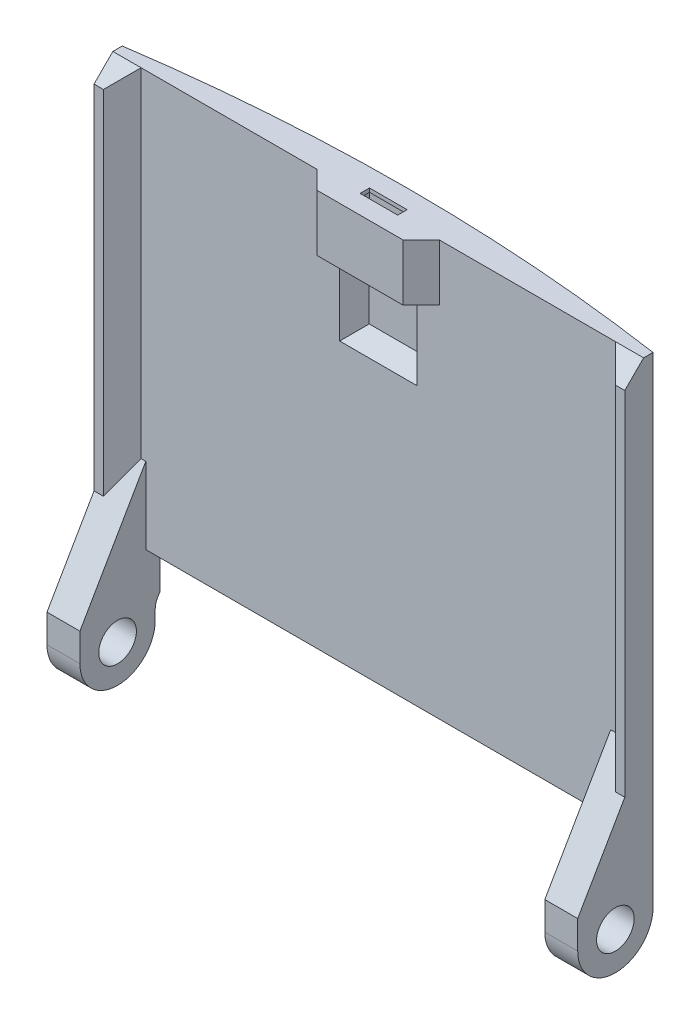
ISO-10303-21;
HEADER;
FILE_DESCRIPTION(('STEP AP214'),'2;1');
FILE_NAME('part.step','',(''),(''),'','','');
FILE_SCHEMA(('AUTOMOTIVE_DESIGN { 1 0 10303 214 1 1 1 1 }'));
ENDSEC;
DATA;
#1=APPLICATION_CONTEXT('core data for automotive mechanical design processes');
#2=APPLICATION_PROTOCOL_DEFINITION('international standard','automotive_design',2000,#1);
#3=PRODUCT_CONTEXT('',#1,'mechanical');
#4=PRODUCT('Part','Part','',(#3));
#5=PRODUCT_RELATED_PRODUCT_CATEGORY('part','',(#4));
#6=PRODUCT_DEFINITION_FORMATION('','',#4);
#7=PRODUCT_DEFINITION_CONTEXT('part definition',#1,'design');
#8=PRODUCT_DEFINITION('design','',#6,#7);
#9=PRODUCT_DEFINITION_SHAPE('','',#8);
#10=(LENGTH_UNIT() NAMED_UNIT(*) SI_UNIT(.MILLI.,.METRE.));
#11=(NAMED_UNIT(*) PLANE_ANGLE_UNIT() SI_UNIT($,.RADIAN.));
#12=(NAMED_UNIT(*) SI_UNIT($,.STERADIAN.) SOLID_ANGLE_UNIT());
#13=UNCERTAINTY_MEASURE_WITH_UNIT(LENGTH_MEASURE(1.E-05),#10,'distance_accuracy_value','');
#14=(GEOMETRIC_REPRESENTATION_CONTEXT(3) GLOBAL_UNCERTAINTY_ASSIGNED_CONTEXT((#13)) GLOBAL_UNIT_ASSIGNED_CONTEXT((#10,
#11,#12)) REPRESENTATION_CONTEXT('',''));
#15=CARTESIAN_POINT('',(0.,0.,0.));
#16=DIRECTION('',(0.,0.,1.));
#17=DIRECTION('',(1.,0.,0.));
#18=AXIS2_PLACEMENT_3D('',#15,#16,#17);
#19=CARTESIAN_POINT('',(0.,48.1,0.));
#20=DIRECTION('',(0.,-1.,0.));
#21=DIRECTION('',(0.,0.,-1.));
#22=AXIS2_PLACEMENT_3D('',#19,#20,#21);
#23=CYLINDRICAL_SURFACE('',#22,193.);
#24=DIRECTION('',(0.,-1.,0.));
#25=VECTOR('',#24,1.);
#26=CARTESIAN_POINT('',(-28.2,48.1,-190.928677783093));
#27=LINE('',#26,#25);
#28=CARTESIAN_POINT('',(-28.2,48.1,-190.928677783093));
#29=VERTEX_POINT('',#28);
#30=CARTESIAN_POINT('',(-28.2,-2.00000000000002,-190.928677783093));
#31=VERTEX_POINT('',#30);
#32=EDGE_CURVE('E526',#29,#31,#27,.T.);
#33=ORIENTED_EDGE('',*,*,#32,.F.);
#34=CARTESIAN_POINT('',(0.,48.1,0.));
#35=DIRECTION('',(0.,1.,0.));
#36=DIRECTION('',(0.,0.,-1.));
#37=AXIS2_PLACEMENT_3D('',#34,#35,#36);
#38=CIRCLE('',#37,193.);
#39=CARTESIAN_POINT('',(28.2,48.1,-190.928677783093));
#40=VERTEX_POINT('',#39);
#41=EDGE_CURVE('E502',#40,#29,#38,.T.);
#42=ORIENTED_EDGE('',*,*,#41,.F.);
#43=DIRECTION('',(0.,-1.,0.));
#44=VECTOR('',#43,1.);
#45=CARTESIAN_POINT('',(28.2,48.1,-190.928677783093));
#46=LINE('',#45,#44);
#47=CARTESIAN_POINT('',(28.2,-2.,-190.928677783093));
#48=VERTEX_POINT('',#47);
#49=EDGE_CURVE('E523',#40,#48,#46,.T.);
#50=ORIENTED_EDGE('',*,*,#49,.T.);
#51=CARTESIAN_POINT('',(28.2,-2.,-190.928677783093));
#52=CARTESIAN_POINT('',(28.2000574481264,-1.98142879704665,-190.928669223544));
#53=CARTESIAN_POINT('',(28.1982512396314,-1.96293990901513,-190.928936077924));
#54=CARTESIAN_POINT('',(28.1914614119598,-1.92682242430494,-190.929938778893));
#55=CARTESIAN_POINT('',(28.1865223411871,-1.90918543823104,-190.93066805));
#56=CARTESIAN_POINT('',(28.1721310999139,-1.86984491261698,-190.932792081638));
#57=CARTESIAN_POINT('',(28.1617747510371,-1.84848715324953,-190.934320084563));
#58=CARTESIAN_POINT('',(28.137849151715,-1.80759935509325,-190.937847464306));
#59=CARTESIAN_POINT('',(28.1242604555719,-1.7880814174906,-190.939849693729));
#60=CARTESIAN_POINT('',(28.083018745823,-1.73573270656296,-190.945921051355));
#61=CARTESIAN_POINT('',(28.0528898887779,-1.70492589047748,-190.950350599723));
#62=CARTESIAN_POINT('',(27.9888905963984,-1.64768307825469,-190.959742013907));
#63=CARTESIAN_POINT('',(27.9550107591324,-1.62125849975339,-190.964705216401));
#64=CARTESIAN_POINT('',(27.8622246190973,-1.55538429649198,-190.978270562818));
#65=CARTESIAN_POINT('',(27.8014203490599,-1.51869436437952,-190.9871329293));
#66=CARTESIAN_POINT('',(27.6768064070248,-1.45084839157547,-191.005231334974));
#67=CARTESIAN_POINT('',(27.6129894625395,-1.41970670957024,-191.014468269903));
#68=CARTESIAN_POINT('',(27.4833971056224,-1.36129485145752,-191.033157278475));
#69=CARTESIAN_POINT('',(27.417616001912,-1.33403758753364,-191.042609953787));
#70=CARTESIAN_POINT('',(27.2849053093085,-1.28250089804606,-191.061609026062));
#71=CARTESIAN_POINT('',(27.2179753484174,-1.25822245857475,-191.071155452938));
#72=CARTESIAN_POINT('',(27.0600363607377,-1.20400034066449,-191.093596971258));
#73=CARTESIAN_POINT('',(26.9687065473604,-1.17500199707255,-191.106508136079));
#74=CARTESIAN_POINT('',(26.7854833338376,-1.12031881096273,-191.13227465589));
#75=CARTESIAN_POINT('',(26.6935937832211,-1.09462086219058,-191.145130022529));
#76=CARTESIAN_POINT('',(26.4459432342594,-1.02897965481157,-191.179592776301));
#77=CARTESIAN_POINT('',(26.2895668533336,-0.99134313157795,-191.201160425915));
#78=CARTESIAN_POINT('',(25.9755956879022,-0.921220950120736,-191.244068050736));
#79=CARTESIAN_POINT('',(25.8180004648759,-0.888737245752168,-191.265407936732));
#80=CARTESIAN_POINT('',(25.5006134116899,-0.827498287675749,-191.307983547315));
#81=CARTESIAN_POINT('',(25.3408144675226,-0.798778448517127,-191.329216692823));
#82=CARTESIAN_POINT('',(25.020742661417,-0.744679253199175,-191.371336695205));
#83=CARTESIAN_POINT('',(24.8604703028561,-0.719297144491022,-191.392223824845));
#84=CARTESIAN_POINT('',(24.7000000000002,-0.69519715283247,-191.4129305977));
#85=B_SPLINE_CURVE_WITH_KNOTS('',3,(#51,#52,#53,#54,#55,#56,#57,#58,#59,#60,#61,#62,#63,#64,#65,
#66,#67,#68,#69,#70,#71,#72,#73,#74,#75,#76,#77,#78,#79,#80,#81,#82,#83,#84),.UNSPECIFIED.,.F.,
.F.,(4,2,2,2,2,2,2,2,2,2,2,2,2,2,2,2,4),(0.,0.0554917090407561,0.110211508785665,
0.181164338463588,0.252555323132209,0.381779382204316,0.511335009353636,0.72547459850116,
0.940160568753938,1.15554431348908,1.37099916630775,1.66098184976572,1.94977481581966,
2.43648258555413,2.9233744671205,3.41456103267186,3.90533995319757),.UNSPECIFIED.);
#86=CARTESIAN_POINT('',(24.7,-0.69519715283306,-191.4129305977));
#87=VERTEX_POINT('',#86);
#88=EDGE_CURVE('E645',#48,#87,#85,.T.);
#89=ORIENTED_EDGE('',*,*,#88,.T.);
#90=DIRECTION('',(0.,-1.,0.));
#91=VECTOR('',#90,1.);
#92=CARTESIAN_POINT('',(24.7,48.1,-191.4129305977));
#93=LINE('',#92,#91);
#94=CARTESIAN_POINT('',(24.7,2.51574718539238,-191.4129305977));
#95=VERTEX_POINT('',#94);
#96=EDGE_CURVE('E580',#87,#95,#93,.F.);
#97=ORIENTED_EDGE('',*,*,#96,.T.);
#98=CARTESIAN_POINT('',(0.,193.928677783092,0.));
#99=DIRECTION('',(0.,0.707106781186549,-0.707106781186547));
#100=DIRECTION('',(0.,-0.707106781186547,-0.707106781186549));
#101=AXIS2_PLACEMENT_3D('',#98,#99,#100);
#102=ELLIPSE('',#101,272.943217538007,193.);
#103=CARTESIAN_POINT('',(24.5776590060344,2.50000000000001,-191.428677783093));
#104=VERTEX_POINT('',#103);
#105=EDGE_CURVE('E587',#95,#104,#102,.T.);
#106=ORIENTED_EDGE('',*,*,#105,.T.);
#107=CARTESIAN_POINT('',(0.,2.50000000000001,0.));
#108=DIRECTION('',(0.,1.,0.));
#109=DIRECTION('',(0.,0.,1.));
#110=AXIS2_PLACEMENT_3D('',#107,#108,#109);
#111=CIRCLE('',#110,193.);
#112=CARTESIAN_POINT('',(-24.5776590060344,2.50000000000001,-191.428677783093));
#113=VERTEX_POINT('',#112);
#114=EDGE_CURVE('E381',#104,#113,#111,.T.);
#115=ORIENTED_EDGE('',*,*,#114,.T.);
#116=CARTESIAN_POINT('',(0.,193.928677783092,0.));
#117=DIRECTION('',(0.,0.707106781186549,-0.707106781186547));
#118=DIRECTION('',(0.,-0.707106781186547,-0.707106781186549));
#119=AXIS2_PLACEMENT_3D('',#116,#117,#118);
#120=ELLIPSE('',#119,272.943217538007,193.);
#121=CARTESIAN_POINT('',(-24.7,2.51574718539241,-191.4129305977));
#122=VERTEX_POINT('',#121);
#123=EDGE_CURVE('E590',#113,#122,#120,.T.);
#124=ORIENTED_EDGE('',*,*,#123,.T.);
#125=DIRECTION('',(0.,-1.,0.));
#126=VECTOR('',#125,1.);
#127=CARTESIAN_POINT('',(-24.7,48.1,-191.4129305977));
#128=LINE('',#127,#126);
#129=CARTESIAN_POINT('',(-24.7,-0.695197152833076,-191.4129305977));
#130=VERTEX_POINT('',#129);
#131=EDGE_CURVE('E577',#122,#130,#128,.T.);
#132=ORIENTED_EDGE('',*,*,#131,.T.);
#133=CARTESIAN_POINT('',(-24.7,-0.695197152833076,-191.4129305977));
#134=CARTESIAN_POINT('',(-24.7927596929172,-0.709104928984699,-191.400960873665));
#135=CARTESIAN_POINT('',(-24.885444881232,-0.723462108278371,-191.388932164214));
#136=CARTESIAN_POINT('',(-25.0706436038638,-0.753191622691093,-191.364760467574));
#137=CARTESIAN_POINT('',(-25.1631571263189,-0.768564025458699,-191.352617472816));
#138=CARTESIAN_POINT('',(-25.4407645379,-0.816440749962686,-191.315975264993));
#139=CARTESIAN_POINT('',(-25.6255467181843,-0.850648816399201,-191.291311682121));
#140=CARTESIAN_POINT('',(-25.9998387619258,-0.926113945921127,-191.240804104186));
#141=CARTESIAN_POINT('',(-26.1893094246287,-0.967562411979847,-191.214947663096));
#142=CARTESIAN_POINT('',(-26.4718072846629,-1.03630575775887,-191.175972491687));
#143=CARTESIAN_POINT('',(-26.5656498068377,-1.06030394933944,-191.162954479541));
#144=CARTESIAN_POINT('',(-26.7525884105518,-1.11101821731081,-191.136882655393));
#145=CARTESIAN_POINT('',(-26.8456845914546,-1.1377339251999,-191.123828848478));
#146=CARTESIAN_POINT('',(-27.006113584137,-1.18703897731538,-191.101215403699));
#147=CARTESIAN_POINT('',(-27.073691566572,-1.20882683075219,-191.091652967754));
#148=CARTESIAN_POINT('',(-27.2081031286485,-1.25471350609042,-191.072561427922));
#149=CARTESIAN_POINT('',(-27.2749363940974,-1.27881326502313,-191.063032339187));
#150=CARTESIAN_POINT('',(-27.4070666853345,-1.32978384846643,-191.044123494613));
#151=CARTESIAN_POINT('',(-27.472370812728,-1.35663591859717,-191.034743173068));
#152=CARTESIAN_POINT('',(-27.6012794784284,-1.41416742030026,-191.016160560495));
#153=CARTESIAN_POINT('',(-27.6648853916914,-1.44484363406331,-191.006958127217));
#154=CARTESIAN_POINT('',(-27.7635269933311,-1.49784547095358,-190.992638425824));
#155=CARTESIAN_POINT('',(-27.7995028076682,-1.51838026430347,-190.987405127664));
#156=CARTESIAN_POINT('',(-27.8700972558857,-1.56192284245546,-190.977116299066));
#157=CARTESIAN_POINT('',(-27.904712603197,-1.5849361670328,-190.972061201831));
#158=CARTESIAN_POINT('',(-27.971972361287,-1.63436089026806,-190.962221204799));
#159=CARTESIAN_POINT('',(-28.004596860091,-1.66080027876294,-190.957439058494));
#160=CARTESIAN_POINT('',(-28.0659108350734,-1.71806393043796,-190.94843699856));
#161=CARTESIAN_POINT('',(-28.0946126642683,-1.74887377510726,-190.944215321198));
#162=CARTESIAN_POINT('',(-28.1319236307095,-1.79913921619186,-190.9387206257));
#163=CARTESIAN_POINT('',(-28.1433440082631,-1.81643624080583,-190.937037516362));
#164=CARTESIAN_POINT('',(-28.1636222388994,-1.85243401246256,-190.934047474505));
#165=CARTESIAN_POINT('',(-28.1724920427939,-1.87112767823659,-190.932738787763));
#166=CARTESIAN_POINT('',(-28.18611826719,-1.90784047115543,-190.930727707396));
#167=CARTESIAN_POINT('',(-28.191204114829,-1.92573096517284,-190.929976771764));
#168=CARTESIAN_POINT('',(-28.1981979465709,-1.96238009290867,-190.928943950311));
#169=CARTESIAN_POINT('',(-28.2000609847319,-1.98114731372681,-190.928668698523));
#170=CARTESIAN_POINT('',(-28.2,-2.00000000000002,-190.928677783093));
#171=B_SPLINE_CURVE_WITH_KNOTS('',3,(#133,#134,#135,#136,#137,#138,#139,#140,#141,#142,#143,
#144,#145,#146,#147,#148,#149,#150,#151,#152,#153,#154,#155,#156,#157,#158,#159,#160,#161,#162,
#163,#164,#165,#166,#167,#168,#169,#170),.UNSPECIFIED.,.F.,.F.,(4,2,2,2,2,2,2,2,2,2,2,2,2,2,2,2,
2,2,4),(0.,0.283670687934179,0.56736029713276,1.13589645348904,1.72272698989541,
2.01589807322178,2.30902945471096,2.5239325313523,2.73892308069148,2.95253542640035,
3.1659692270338,3.29116431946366,3.41664528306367,3.54322498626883,3.66939640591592,
3.73162724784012,3.79356156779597,3.84912075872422,3.90544872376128),.UNSPECIFIED.);
#172=EDGE_CURVE('E612',#130,#31,#171,.T.);
#173=ORIENTED_EDGE('',*,*,#172,.T.);
#174=EDGE_LOOP('',(#33,#42,#50,#89,#97,#106,#115,#124,#132,#173));
#175=FACE_BOUND('',#174,.T.);
#176=ADVANCED_FACE('F46',(#175),#23,.T.);
#177=CARTESIAN_POINT('',(0.,48.1,0.));
#178=DIRECTION('',(0.,-1.,0.));
#179=DIRECTION('',(0.,0.,-1.));
#180=AXIS2_PLACEMENT_3D('',#177,#178,#179);
#181=PLANE('',#180);
#182=ORIENTED_EDGE('',*,*,#41,.T.);
#183=DIRECTION('',(0.,0.,1.));
#184=VECTOR('',#183,1.);
#185=CARTESIAN_POINT('',(-28.2,48.1,-190.928677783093));
#186=LINE('',#185,#184);
#187=CARTESIAN_POINT('',(-28.2,48.1,-189.928677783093));
#188=VERTEX_POINT('',#187);
#189=EDGE_CURVE('E511',#29,#188,#186,.T.);
#190=ORIENTED_EDGE('',*,*,#189,.T.);
#191=DIRECTION('',(1.,0.,0.));
#192=VECTOR('',#191,1.);
#193=CARTESIAN_POINT('',(-28.2,48.1,-189.928677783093));
#194=LINE('',#193,#192);
#195=CARTESIAN_POINT('',(-25.2,48.1,-189.928677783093));
#196=VERTEX_POINT('',#195);
#197=EDGE_CURVE('E516',#188,#196,#194,.T.);
#198=ORIENTED_EDGE('',*,*,#197,.T.);
#199=CARTESIAN_POINT('',(-6.50000000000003,48.1,-189.928677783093));
#200=VERTEX_POINT('',#199);
#201=EDGE_CURVE('E520',#196,#200,#194,.T.);
#202=ORIENTED_EDGE('',*,*,#201,.T.);
#203=DIRECTION('',(0.707106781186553,0.,0.707106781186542));
#204=VECTOR('',#203,1.);
#205=CARTESIAN_POINT('',(91.7143388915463,48.1,-91.7143388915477));
#206=LINE('',#205,#204);
#207=CARTESIAN_POINT('',(-4.5713222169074,48.1,-188.));
#208=VERTEX_POINT('',#207);
#209=EDGE_CURVE('E713',#200,#208,#206,.T.);
#210=ORIENTED_EDGE('',*,*,#209,.T.);
#211=DIRECTION('',(1.,0.,0.));
#212=VECTOR('',#211,1.);
#213=CARTESIAN_POINT('',(-4.5,48.1,-188.));
#214=LINE('',#213,#212);
#215=CARTESIAN_POINT('',(4.57132221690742,48.1,-188.));
#216=VERTEX_POINT('',#215);
#217=EDGE_CURVE('E71',#208,#216,#214,.T.);
#218=ORIENTED_EDGE('',*,*,#217,.T.);
#219=DIRECTION('',(0.707106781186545,0.,-0.70710678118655));
#220=VECTOR('',#219,1.);
#221=CARTESIAN_POINT('',(-91.7143388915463,48.1,-91.7143388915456));
#222=LINE('',#221,#220);
#223=CARTESIAN_POINT('',(6.50000000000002,48.1,-189.928677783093));
#224=VERTEX_POINT('',#223);
#225=EDGE_CURVE('E56',#216,#224,#222,.T.);
#226=ORIENTED_EDGE('',*,*,#225,.T.);
#227=CARTESIAN_POINT('',(25.2,48.1,-189.928677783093));
#228=VERTEX_POINT('',#227);
#229=EDGE_CURVE('E515',#224,#228,#194,.T.);
#230=ORIENTED_EDGE('',*,*,#229,.T.);
#231=DIRECTION('',(1.,0.,0.));
#232=VECTOR('',#231,1.);
#233=CARTESIAN_POINT('',(27.2,48.1,-189.928677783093));
#234=LINE('',#233,#232);
#235=CARTESIAN_POINT('',(28.2,48.1,-189.928677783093));
#236=VERTEX_POINT('',#235);
#237=EDGE_CURVE('E410',#228,#236,#234,.T.);
#238=ORIENTED_EDGE('',*,*,#237,.T.);
#239=DIRECTION('',(0.,0.,-1.));
#240=VECTOR('',#239,1.);
#241=CARTESIAN_POINT('',(28.2,48.1,-189.928677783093));
#242=LINE('',#241,#240);
#243=EDGE_CURVE('E519',#236,#40,#242,.T.);
#244=ORIENTED_EDGE('',*,*,#243,.T.);
#245=EDGE_LOOP('',(#182,#190,#198,#202,#210,#218,#226,#230,#238,#244));
#246=FACE_BOUND('',#245,.T.);
#247=DIRECTION('',(0.,0.,1.));
#248=VECTOR('',#247,1.);
#249=CARTESIAN_POINT('',(-2.,48.1,-191.));
#250=LINE('',#249,#248);
#251=CARTESIAN_POINT('',(-2.,48.1,-191.));
#252=VERTEX_POINT('',#251);
#253=CARTESIAN_POINT('',(-2.,48.1,-190.));
#254=VERTEX_POINT('',#253);
#255=EDGE_CURVE('E298',#252,#254,#250,.T.);
#256=ORIENTED_EDGE('',*,*,#255,.F.);
#257=DIRECTION('',(-1.,0.,0.));
#258=VECTOR('',#257,1.);
#259=CARTESIAN_POINT('',(-2.,48.1,-191.));
#260=LINE('',#259,#258);
#261=CARTESIAN_POINT('',(2.,48.1,-191.));
#262=VERTEX_POINT('',#261);
#263=EDGE_CURVE('E319',#262,#252,#260,.T.);
#264=ORIENTED_EDGE('',*,*,#263,.F.);
#265=DIRECTION('',(0.,0.,-1.));
#266=VECTOR('',#265,1.);
#267=CARTESIAN_POINT('',(2.,48.1,-191.));
#268=LINE('',#267,#266);
#269=CARTESIAN_POINT('',(2.,48.1,-190.));
#270=VERTEX_POINT('',#269);
#271=EDGE_CURVE('E323',#270,#262,#268,.T.);
#272=ORIENTED_EDGE('',*,*,#271,.F.);
#273=DIRECTION('',(1.,0.,0.));
#274=VECTOR('',#273,1.);
#275=CARTESIAN_POINT('',(-2.,48.1,-190.));
#276=LINE('',#275,#274);
#277=EDGE_CURVE('E332',#254,#270,#276,.T.);
#278=ORIENTED_EDGE('',*,*,#277,.F.);
#279=EDGE_LOOP('',(#256,#264,#272,#278));
#280=FACE_BOUND('',#279,.T.);
#281=ADVANCED_FACE('F727',(#246,#280),#181,.F.);
#282=CARTESIAN_POINT('',(-2.5,22.7148351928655,-191.5));
#283=DIRECTION('',(-1.,0.,0.));
#284=DIRECTION('',(0.,0.,1.));
#285=AXIS2_PLACEMENT_3D('',#282,#283,#284);
#286=PLANE('',#285);
#287=DIRECTION('',(0.,0.,1.));
#288=VECTOR('',#287,1.);
#289=CARTESIAN_POINT('',(-2.5,42.1,0.));
#290=LINE('',#289,#288);
#291=CARTESIAN_POINT('',(-2.5,42.1,-191.5));
#292=VERTEX_POINT('',#291);
#293=CARTESIAN_POINT('',(-2.5,42.1,-189.5));
#294=VERTEX_POINT('',#293);
#295=EDGE_CURVE('E663',#292,#294,#290,.T.);
#296=ORIENTED_EDGE('',*,*,#295,.F.);
#297=DIRECTION('',(0.,1.,0.));
#298=VECTOR('',#297,1.);
#299=CARTESIAN_POINT('',(-2.5,22.7148351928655,-191.5));
#300=LINE('',#299,#298);
#301=CARTESIAN_POINT('',(-2.5,47.7,-191.5));
#302=VERTEX_POINT('',#301);
#303=EDGE_CURVE('E362',#292,#302,#300,.T.);
#304=ORIENTED_EDGE('',*,*,#303,.T.);
#305=DIRECTION('',(0.,0.,1.));
#306=VECTOR('',#305,1.);
#307=CARTESIAN_POINT('',(-2.5,47.7,-191.5));
#308=LINE('',#307,#306);
#309=CARTESIAN_POINT('',(-2.5,47.7,-189.5));
#310=VERTEX_POINT('',#309);
#311=EDGE_CURVE('E342',#302,#310,#308,.T.);
#312=ORIENTED_EDGE('',*,*,#311,.T.);
#313=DIRECTION('',(0.,1.,0.));
#314=VECTOR('',#313,1.);
#315=CARTESIAN_POINT('',(-2.5,22.7148351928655,-189.5));
#316=LINE('',#315,#314);
#317=EDGE_CURVE('E361',#294,#310,#316,.T.);
#318=ORIENTED_EDGE('',*,*,#317,.F.);
#319=EDGE_LOOP('',(#296,#304,#312,#318));
#320=FACE_BOUND('',#319,.T.);
#321=ADVANCED_FACE('F762',(#320),#286,.F.);
#322=CARTESIAN_POINT('',(2.5,22.7148351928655,-191.5));
#323=DIRECTION('',(1.,0.,0.));
#324=DIRECTION('',(0.,0.,-1.));
#325=AXIS2_PLACEMENT_3D('',#322,#323,#324);
#326=PLANE('',#325);
#327=DIRECTION('',(0.,1.,0.));
#328=VECTOR('',#327,1.);
#329=CARTESIAN_POINT('',(2.5,22.7148351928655,-191.5));
#330=LINE('',#329,#328);
#331=CARTESIAN_POINT('',(2.5,42.1,-191.5));
#332=VERTEX_POINT('',#331);
#333=CARTESIAN_POINT('',(2.5,47.7,-191.5));
#334=VERTEX_POINT('',#333);
#335=EDGE_CURVE('E365',#332,#334,#330,.T.);
#336=ORIENTED_EDGE('',*,*,#335,.F.);
#337=DIRECTION('',(0.,0.,-1.));
#338=VECTOR('',#337,1.);
#339=CARTESIAN_POINT('',(2.5,42.1,0.));
#340=LINE('',#339,#338);
#341=CARTESIAN_POINT('',(2.5,42.1,-189.5));
#342=VERTEX_POINT('',#341);
#343=EDGE_CURVE('E660',#342,#332,#340,.T.);
#344=ORIENTED_EDGE('',*,*,#343,.F.);
#345=DIRECTION('',(0.,1.,0.));
#346=VECTOR('',#345,1.);
#347=CARTESIAN_POINT('',(2.5,22.7148351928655,-189.5));
#348=LINE('',#347,#346);
#349=CARTESIAN_POINT('',(2.5,47.7,-189.5));
#350=VERTEX_POINT('',#349);
#351=EDGE_CURVE('E368',#342,#350,#348,.T.);
#352=ORIENTED_EDGE('',*,*,#351,.T.);
#353=DIRECTION('',(0.,0.,-1.));
#354=VECTOR('',#353,1.);
#355=CARTESIAN_POINT('',(2.5,47.7,-191.5));
#356=LINE('',#355,#354);
#357=EDGE_CURVE('E353',#350,#334,#356,.T.);
#358=ORIENTED_EDGE('',*,*,#357,.T.);
#359=EDGE_LOOP('',(#336,#344,#352,#358));
#360=FACE_BOUND('',#359,.T.);
#361=ADVANCED_FACE('F772',(#360),#326,.F.);
#362=CARTESIAN_POINT('',(-2.5,22.7148351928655,-189.5));
#363=DIRECTION('',(0.,0.,1.));
#364=DIRECTION('',(1.,0.,0.));
#365=AXIS2_PLACEMENT_3D('',#362,#363,#364);
#366=PLANE('',#365);
#367=DIRECTION('',(1.,0.,0.));
#368=VECTOR('',#367,1.);
#369=CARTESIAN_POINT('',(-2.5,47.7,-189.5));
#370=LINE('',#369,#368);
#371=EDGE_CURVE('E350',#310,#350,#370,.T.);
#372=ORIENTED_EDGE('',*,*,#371,.T.);
#373=ORIENTED_EDGE('',*,*,#351,.F.);
#374=DIRECTION('',(1.,0.,0.));
#375=VECTOR('',#374,1.);
#376=CARTESIAN_POINT('',(0.,42.1,-189.5));
#377=LINE('',#376,#375);
#378=EDGE_CURVE('E656',#294,#342,#377,.T.);
#379=ORIENTED_EDGE('',*,*,#378,.F.);
#380=ORIENTED_EDGE('',*,*,#317,.T.);
#381=EDGE_LOOP('',(#372,#373,#379,#380));
#382=FACE_BOUND('',#381,.T.);
#383=ADVANCED_FACE('F767',(#382),#366,.F.);
#384=CARTESIAN_POINT('',(-2.5,22.7148351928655,-191.5));
#385=DIRECTION('',(0.,0.,-1.));
#386=DIRECTION('',(-1.,0.,0.));
#387=AXIS2_PLACEMENT_3D('',#384,#385,#386);
#388=PLANE('',#387);
#389=DIRECTION('',(-1.,0.,0.));
#390=VECTOR('',#389,1.);
#391=CARTESIAN_POINT('',(0.,42.1,-191.5));
#392=LINE('',#391,#390);
#393=CARTESIAN_POINT('',(-2.52867778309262,42.1,-191.5));
#394=VERTEX_POINT('',#393);
#395=EDGE_CURVE('E692',#292,#394,#392,.T.);
#396=ORIENTED_EDGE('',*,*,#395,.T.);
#397=DIRECTION('',(0.,1.,0.));
#398=VECTOR('',#397,1.);
#399=CARTESIAN_POINT('',(-2.52867778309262,22.7148351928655,-191.5));
#400=LINE('',#399,#398);
#401=CARTESIAN_POINT('',(-2.52867778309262,35.0713222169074,-191.5));
#402=VERTEX_POINT('',#401);
#403=EDGE_CURVE('E689',#394,#402,#400,.F.);
#404=ORIENTED_EDGE('',*,*,#403,.T.);
#405=DIRECTION('',(1.,0.,0.));
#406=VECTOR('',#405,1.);
#407=CARTESIAN_POINT('',(-2.5,35.0713222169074,-191.5));
#408=LINE('',#407,#406);
#409=CARTESIAN_POINT('',(2.52867778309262,35.0713222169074,-191.5));
#410=VERTEX_POINT('',#409);
#411=EDGE_CURVE('E683',#402,#410,#408,.T.);
#412=ORIENTED_EDGE('',*,*,#411,.T.);
#413=DIRECTION('',(0.,-1.,0.));
#414=VECTOR('',#413,1.);
#415=CARTESIAN_POINT('',(2.52867778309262,22.7148351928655,-191.5));
#416=LINE('',#415,#414);
#417=CARTESIAN_POINT('',(2.52867778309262,42.1,-191.5));
#418=VERTEX_POINT('',#417);
#419=EDGE_CURVE('E677',#410,#418,#416,.F.);
#420=ORIENTED_EDGE('',*,*,#419,.T.);
#421=DIRECTION('',(-1.,0.,0.));
#422=VECTOR('',#421,1.);
#423=CARTESIAN_POINT('',(0.,42.1,-191.5));
#424=LINE('',#423,#422);
#425=EDGE_CURVE('E693',#332,#418,#424,.F.);
#426=ORIENTED_EDGE('',*,*,#425,.F.);
#427=ORIENTED_EDGE('',*,*,#335,.T.);
#428=DIRECTION('',(-1.,0.,0.));
#429=VECTOR('',#428,1.);
#430=CARTESIAN_POINT('',(-2.5,47.7,-191.5));
#431=LINE('',#430,#429);
#432=EDGE_CURVE('E357',#334,#302,#431,.T.);
#433=ORIENTED_EDGE('',*,*,#432,.T.);
#434=ORIENTED_EDGE('',*,*,#303,.F.);
#435=EDGE_LOOP('',(#396,#404,#412,#420,#426,#427,#433,#434));
#436=FACE_BOUND('',#435,.T.);
#437=ADVANCED_FACE('F758',(#436),#388,.F.);
#438=CARTESIAN_POINT('',(-28.2,48.1,-189.928677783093));
#439=DIRECTION('',(0.,0.,-1.));
#440=DIRECTION('',(-1.,0.,0.));
#441=AXIS2_PLACEMENT_3D('',#438,#439,#440);
#442=PLANE('',#441);
#443=DIRECTION('',(-1.,0.,0.));
#444=VECTOR('',#443,1.);
#445=CARTESIAN_POINT('',(-4.5,42.1,-189.928677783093));
#446=LINE('',#445,#444);
#447=CARTESIAN_POINT('',(-4.10000000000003,42.1,-189.928677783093));
#448=VERTEX_POINT('',#447);
#449=CARTESIAN_POINT('',(-6.50000000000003,42.1,-189.928677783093));
#450=VERTEX_POINT('',#449);
#451=EDGE_CURVE('E82',#448,#450,#446,.T.);
#452=ORIENTED_EDGE('',*,*,#451,.T.);
#453=DIRECTION('',(0.,1.,0.));
#454=VECTOR('',#453,1.);
#455=CARTESIAN_POINT('',(-6.50000000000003,48.1,-189.928677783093));
#456=LINE('',#455,#454);
#457=EDGE_CURVE('E710',#450,#200,#456,.T.);
#458=ORIENTED_EDGE('',*,*,#457,.T.);
#459=ORIENTED_EDGE('',*,*,#201,.F.);
#460=DIRECTION('',(0.,-1.,0.));
#461=VECTOR('',#460,1.);
#462=CARTESIAN_POINT('',(-25.2,12.1243556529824,-189.928677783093));
#463=LINE('',#462,#461);
#464=CARTESIAN_POINT('',(-25.2,12.1243556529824,-189.928677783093));
#465=VERTEX_POINT('',#464);
#466=EDGE_CURVE('E561',#196,#465,#463,.T.);
#467=ORIENTED_EDGE('',*,*,#466,.T.);
#468=DIRECTION('',(1.,0.,0.));
#469=VECTOR('',#468,1.);
#470=CARTESIAN_POINT('',(-24.7,12.1243556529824,-189.928677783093));
#471=LINE('',#470,#469);
#472=CARTESIAN_POINT('',(-24.7,12.1243556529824,-189.928677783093));
#473=VERTEX_POINT('',#472);
#474=EDGE_CURVE('E547',#465,#473,#471,.T.);
#475=ORIENTED_EDGE('',*,*,#474,.T.);
#476=DIRECTION('',(0.,-1.,0.));
#477=VECTOR('',#476,1.);
#478=CARTESIAN_POINT('',(-24.7,-3.,-189.928677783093));
#479=LINE('',#478,#477);
#480=CARTESIAN_POINT('',(-24.7,4.,-189.928677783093));
#481=VERTEX_POINT('',#480);
#482=EDGE_CURVE('E543',#473,#481,#479,.T.);
#483=ORIENTED_EDGE('',*,*,#482,.T.);
#484=DIRECTION('',(1.,0.,0.));
#485=VECTOR('',#484,1.);
#486=CARTESIAN_POINT('',(-28.2,4.,-189.928677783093));
#487=LINE('',#486,#485);
#488=CARTESIAN_POINT('',(24.7,4.,-189.928677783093));
#489=VERTEX_POINT('',#488);
#490=EDGE_CURVE('E594',#481,#489,#487,.T.);
#491=ORIENTED_EDGE('',*,*,#490,.T.);
#492=DIRECTION('',(0.,1.,0.));
#493=VECTOR('',#492,1.);
#494=CARTESIAN_POINT('',(24.7,-3.,-189.928677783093));
#495=LINE('',#494,#493);
#496=CARTESIAN_POINT('',(24.7,12.1243556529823,-189.928677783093));
#497=VERTEX_POINT('',#496);
#498=EDGE_CURVE('E529',#489,#497,#495,.T.);
#499=ORIENTED_EDGE('',*,*,#498,.T.);
#500=DIRECTION('',(1.,0.,0.));
#501=VECTOR('',#500,1.);
#502=CARTESIAN_POINT('',(-28.2,12.1243556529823,-189.928677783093));
#503=LINE('',#502,#501);
#504=CARTESIAN_POINT('',(25.2,12.1243556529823,-189.928677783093));
#505=VERTEX_POINT('',#504);
#506=EDGE_CURVE('E532',#497,#505,#503,.T.);
#507=ORIENTED_EDGE('',*,*,#506,.T.);
#508=DIRECTION('',(0.,1.,0.));
#509=VECTOR('',#508,1.);
#510=CARTESIAN_POINT('',(25.2,48.1,-189.928677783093));
#511=LINE('',#510,#509);
#512=EDGE_CURVE('E557',#505,#228,#511,.T.);
#513=ORIENTED_EDGE('',*,*,#512,.T.);
#514=ORIENTED_EDGE('',*,*,#229,.F.);
#515=DIRECTION('',(0.,-1.,0.));
#516=VECTOR('',#515,1.);
#517=CARTESIAN_POINT('',(6.50000000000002,48.1,-189.928677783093));
#518=LINE('',#517,#516);
#519=CARTESIAN_POINT('',(6.50000000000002,42.1,-189.928677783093));
#520=VERTEX_POINT('',#519);
#521=EDGE_CURVE('E697',#224,#520,#518,.T.);
#522=ORIENTED_EDGE('',*,*,#521,.T.);
#523=CARTESIAN_POINT('',(4.10000000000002,42.1,-189.928677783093));
#524=VERTEX_POINT('',#523);
#525=EDGE_CURVE('E377',#520,#524,#446,.T.);
#526=ORIENTED_EDGE('',*,*,#525,.T.);
#527=DIRECTION('',(0.,-1.,0.));
#528=VECTOR('',#527,1.);
#529=CARTESIAN_POINT('',(4.10000000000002,48.1,-189.928677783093));
#530=LINE('',#529,#528);
#531=CARTESIAN_POINT('',(4.10000000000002,33.5,-189.928677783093));
#532=VERTEX_POINT('',#531);
#533=EDGE_CURVE('E673',#524,#532,#530,.T.);
#534=ORIENTED_EDGE('',*,*,#533,.T.);
#535=DIRECTION('',(-1.,0.,0.));
#536=VECTOR('',#535,1.);
#537=CARTESIAN_POINT('',(-2.5,33.5,-189.928677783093));
#538=LINE('',#537,#536);
#539=CARTESIAN_POINT('',(-4.10000000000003,33.5,-189.928677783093));
#540=VERTEX_POINT('',#539);
#541=EDGE_CURVE('E670',#532,#540,#538,.T.);
#542=ORIENTED_EDGE('',*,*,#541,.T.);
#543=DIRECTION('',(0.,1.,0.));
#544=VECTOR('',#543,1.);
#545=CARTESIAN_POINT('',(-4.10000000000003,48.1,-189.928677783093));
#546=LINE('',#545,#544);
#547=EDGE_CURVE('E667',#540,#448,#546,.T.);
#548=ORIENTED_EDGE('',*,*,#547,.T.);
#549=EDGE_LOOP('',(#452,#458,#459,#467,#475,#483,#491,#499,#507,#513,#514,#522,#526,#534,#542,#548));
#550=FACE_BOUND('',#549,.T.);
#551=ADVANCED_FACE('F733',(#550),#442,.F.);
#552=CARTESIAN_POINT('',(-28.2,12.1243556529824,-189.928677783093));
#553=DIRECTION('',(0.,0.499999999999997,0.866025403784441));
#554=DIRECTION('',(-1.,0.,0.));
#555=AXIS2_PLACEMENT_3D('',#552,#553,#554);
#556=PLANE('',#555);
#557=ORIENTED_EDGE('',*,*,#474,.F.);
#558=DIRECTION('',(-0.447213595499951,-0.774596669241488,0.447213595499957));
#559=VECTOR('',#558,1.);
#560=CARTESIAN_POINT('',(-30.2,3.46410161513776,-184.928677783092));
#561=LINE('',#560,#559);
#562=CARTESIAN_POINT('',(-27.2,8.66025403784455,-187.928677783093));
#563=VERTEX_POINT('',#562);
#564=EDGE_CURVE('E564',#465,#563,#561,.T.);
#565=ORIENTED_EDGE('',*,*,#564,.T.);
#566=DIRECTION('',(-1.,0.,0.));
#567=VECTOR('',#566,1.);
#568=CARTESIAN_POINT('',(-27.2,8.66025403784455,-187.928677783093));
#569=LINE('',#568,#567);
#570=CARTESIAN_POINT('',(-28.2,8.66025403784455,-187.928677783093));
#571=VERTEX_POINT('',#570);
#572=EDGE_CURVE('E392',#563,#571,#569,.T.);
#573=ORIENTED_EDGE('',*,*,#572,.T.);
#574=DIRECTION('',(0.,-0.86602540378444,0.499999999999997));
#575=VECTOR('',#574,1.);
#576=CARTESIAN_POINT('',(-28.2,39.5391016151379,-205.756588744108));
#577=LINE('',#576,#575);
#578=CARTESIAN_POINT('',(-28.2,0.,-182.928677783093));
#579=VERTEX_POINT('',#578);
#580=EDGE_CURVE('E553',#579,#571,#577,.F.);
#581=ORIENTED_EDGE('',*,*,#580,.F.);
#582=DIRECTION('',(-1.,0.,0.));
#583=VECTOR('',#582,1.);
#584=CARTESIAN_POINT('',(-24.7,0.,-182.928677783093));
#585=LINE('',#584,#583);
#586=CARTESIAN_POINT('',(-24.7,0.,-182.928677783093));
#587=VERTEX_POINT('',#586);
#588=EDGE_CURVE('E456',#587,#579,#585,.T.);
#589=ORIENTED_EDGE('',*,*,#588,.F.);
#590=DIRECTION('',(0.,0.866025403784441,-0.499999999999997));
#591=VECTOR('',#590,1.);
#592=CARTESIAN_POINT('',(-24.7,-0.517949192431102,-182.629639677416));
#593=LINE('',#592,#591);
#594=EDGE_CURVE('E550',#473,#587,#593,.F.);
#595=ORIENTED_EDGE('',*,*,#594,.F.);
#596=EDGE_LOOP('',(#557,#565,#573,#581,#589,#595));
#597=FACE_BOUND('',#596,.T.);
#598=ADVANCED_FACE('F817',(#597),#556,.T.);
#599=CARTESIAN_POINT('',(-28.2,48.1,-190.928677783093));
#600=DIRECTION('',(1.,0.,0.));
#601=DIRECTION('',(0.,0.,-1.));
#602=AXIS2_PLACEMENT_3D('',#599,#600,#601);
#603=PLANE('',#602);
#604=ORIENTED_EDGE('',*,*,#32,.T.);
#605=DIRECTION('',(0.,1.,0.));
#606=VECTOR('',#605,1.);
#607=CARTESIAN_POINT('',(-28.2,0.,-190.928677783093));
#608=LINE('',#607,#606);
#609=CARTESIAN_POINT('',(-28.2,-3.,-190.928677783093));
#610=VERTEX_POINT('',#609);
#611=EDGE_CURVE('E432',#610,#31,#608,.T.);
#612=ORIENTED_EDGE('',*,*,#611,.F.);
#613=CARTESIAN_POINT('',(-28.2,-3.,-186.928677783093));
#614=DIRECTION('',(1.,0.,0.));
#615=DIRECTION('',(0.,0.,-1.));
#616=AXIS2_PLACEMENT_3D('',#613,#614,#615);
#617=CIRCLE('',#616,4.00000000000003);
#618=CARTESIAN_POINT('',(-28.2,-3.,-182.928677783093));
#619=VERTEX_POINT('',#618);
#620=EDGE_CURVE('E451',#619,#610,#617,.T.);
#621=ORIENTED_EDGE('',*,*,#620,.F.);
#622=DIRECTION('',(0.,-1.,0.));
#623=VECTOR('',#622,1.);
#624=CARTESIAN_POINT('',(-28.2,0.,-182.928677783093));
#625=LINE('',#624,#623);
#626=EDGE_CURVE('E441',#579,#619,#625,.T.);
#627=ORIENTED_EDGE('',*,*,#626,.F.);
#628=ORIENTED_EDGE('',*,*,#580,.T.);
#629=DIRECTION('',(0.,-1.,0.));
#630=VECTOR('',#629,1.);
#631=CARTESIAN_POINT('',(-28.2,46.1,-187.928677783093));
#632=LINE('',#631,#630);
#633=CARTESIAN_POINT('',(-28.2,46.1,-187.928677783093));
#634=VERTEX_POINT('',#633);
#635=EDGE_CURVE('E387',#634,#571,#632,.T.);
#636=ORIENTED_EDGE('',*,*,#635,.F.);
#637=DIRECTION('',(0.,-0.707106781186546,0.707106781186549));
#638=VECTOR('',#637,1.);
#639=CARTESIAN_POINT('',(-28.2,48.1,-189.928677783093));
#640=LINE('',#639,#638);
#641=EDGE_CURVE('E393',#188,#634,#640,.T.);
#642=ORIENTED_EDGE('',*,*,#641,.F.);
#643=ORIENTED_EDGE('',*,*,#189,.F.);
#644=EDGE_LOOP('',(#604,#612,#621,#627,#628,#636,#642,#643));
#645=FACE_BOUND('',#644,.T.);
#646=CARTESIAN_POINT('',(-28.2,-3.,-186.928677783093));
#647=DIRECTION('',(1.,0.,0.));
#648=DIRECTION('',(0.,0.,-1.));
#649=AXIS2_PLACEMENT_3D('',#646,#647,#648);
#650=CIRCLE('',#649,2.);
#651=CARTESIAN_POINT('',(-28.2,-3.,-188.928677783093));
#652=VERTEX_POINT('',#651);
#653=EDGE_CURVE('E421',#652,#652,#650,.T.);
#654=ORIENTED_EDGE('',*,*,#653,.T.);
#655=EDGE_LOOP('',(#654));
#656=FACE_BOUND('',#655,.T.);
#657=ADVANCED_FACE('F799',(#645,#656),#603,.F.);
#658=CARTESIAN_POINT('',(28.2,48.1,-189.928677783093));
#659=DIRECTION('',(-1.,0.,0.));
#660=DIRECTION('',(0.,0.,1.));
#661=AXIS2_PLACEMENT_3D('',#658,#659,#660);
#662=PLANE('',#661);
#663=DIRECTION('',(0.,1.,0.));
#664=VECTOR('',#663,1.);
#665=CARTESIAN_POINT('',(28.2,0.,-190.928677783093));
#666=LINE('',#665,#664);
#667=CARTESIAN_POINT('',(28.2,-3.,-190.928677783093));
#668=VERTEX_POINT('',#667);
#669=EDGE_CURVE('E471',#668,#48,#666,.T.);
#670=ORIENTED_EDGE('',*,*,#669,.T.);
#671=ORIENTED_EDGE('',*,*,#49,.F.);
#672=ORIENTED_EDGE('',*,*,#243,.F.);
#673=DIRECTION('',(0.,-0.707106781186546,0.707106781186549));
#674=VECTOR('',#673,1.);
#675=CARTESIAN_POINT('',(28.2,48.1,-189.928677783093));
#676=LINE('',#675,#674);
#677=CARTESIAN_POINT('',(28.2,46.1,-187.928677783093));
#678=VERTEX_POINT('',#677);
#679=EDGE_CURVE('E402',#236,#678,#676,.T.);
#680=ORIENTED_EDGE('',*,*,#679,.T.);
#681=DIRECTION('',(0.,-1.,0.));
#682=VECTOR('',#681,1.);
#683=CARTESIAN_POINT('',(28.2,46.1,-187.928677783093));
#684=LINE('',#683,#682);
#685=CARTESIAN_POINT('',(28.2,8.66025403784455,-187.928677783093));
#686=VERTEX_POINT('',#685);
#687=EDGE_CURVE('E411',#678,#686,#684,.T.);
#688=ORIENTED_EDGE('',*,*,#687,.T.);
#689=DIRECTION('',(0.,-0.866025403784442,0.499999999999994));
#690=VECTOR('',#689,1.);
#691=CARTESIAN_POINT('',(28.2,39.1060889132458,-205.506588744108));
#692=LINE('',#691,#690);
#693=CARTESIAN_POINT('',(28.2,0.,-182.928677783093));
#694=VERTEX_POINT('',#693);
#695=EDGE_CURVE('E536',#686,#694,#692,.T.);
#696=ORIENTED_EDGE('',*,*,#695,.T.);
#697=DIRECTION('',(0.,-1.,0.));
#698=VECTOR('',#697,1.);
#699=CARTESIAN_POINT('',(28.2,0.,-182.928677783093));
#700=LINE('',#699,#698);
#701=CARTESIAN_POINT('',(28.2,-3.,-182.928677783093));
#702=VERTEX_POINT('',#701);
#703=EDGE_CURVE('E492',#694,#702,#700,.T.);
#704=ORIENTED_EDGE('',*,*,#703,.T.);
#705=CARTESIAN_POINT('',(28.2,-3.,-186.928677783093));
#706=DIRECTION('',(1.,0.,0.));
#707=DIRECTION('',(0.,0.,-1.));
#708=AXIS2_PLACEMENT_3D('',#705,#706,#707);
#709=CIRCLE('',#708,4.00000000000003);
#710=EDGE_CURVE('E480',#702,#668,#709,.T.);
#711=ORIENTED_EDGE('',*,*,#710,.T.);
#712=EDGE_LOOP('',(#670,#671,#672,#680,#688,#696,#704,#711));
#713=FACE_BOUND('',#712,.T.);
#714=CARTESIAN_POINT('',(28.2,-3.,-186.928677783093));
#715=DIRECTION('',(1.,0.,0.));
#716=DIRECTION('',(0.,0.,-1.));
#717=AXIS2_PLACEMENT_3D('',#714,#715,#716);
#718=CIRCLE('',#717,2.);
#719=CARTESIAN_POINT('',(28.2,-3.,-188.928677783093));
#720=VERTEX_POINT('',#719);
#721=EDGE_CURVE('E459',#720,#720,#718,.T.);
#722=ORIENTED_EDGE('',*,*,#721,.F.);
#723=EDGE_LOOP('',(#722));
#724=FACE_BOUND('',#723,.T.);
#725=ADVANCED_FACE('F835',(#713,#724),#662,.F.);
#726=CARTESIAN_POINT('',(24.7,0.,-190.928677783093));
#727=DIRECTION('',(0.,0.,-1.));
#728=DIRECTION('',(0.,1.,0.));
#729=AXIS2_PLACEMENT_3D('',#726,#727,#728);
#730=PLANE('',#729);
#731=DIRECTION('',(0.,1.,0.));
#732=VECTOR('',#731,1.);
#733=CARTESIAN_POINT('',(24.7,0.,-190.928677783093));
#734=LINE('',#733,#732);
#735=CARTESIAN_POINT('',(24.7,-3.,-190.928677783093));
#736=VERTEX_POINT('',#735);
#737=CARTESIAN_POINT('',(24.7,-2.00000000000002,-190.928677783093));
#738=VERTEX_POINT('',#737);
#739=EDGE_CURVE('E475',#736,#738,#734,.T.);
#740=ORIENTED_EDGE('',*,*,#739,.T.);
#741=DIRECTION('',(1.,0.,0.));
#742=VECTOR('',#741,1.);
#743=CARTESIAN_POINT('',(28.2,-2.00000000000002,-190.928677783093));
#744=LINE('',#743,#742);
#745=EDGE_CURVE('E608',#738,#48,#744,.T.);
#746=ORIENTED_EDGE('',*,*,#745,.T.);
#747=ORIENTED_EDGE('',*,*,#669,.F.);
#748=DIRECTION('',(1.,0.,0.));
#749=VECTOR('',#748,1.);
#750=CARTESIAN_POINT('',(24.7,-3.,-190.928677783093));
#751=LINE('',#750,#749);
#752=EDGE_CURVE('E499',#736,#668,#751,.T.);
#753=ORIENTED_EDGE('',*,*,#752,.F.);
#754=EDGE_LOOP('',(#740,#746,#747,#753));
#755=FACE_BOUND('',#754,.T.);
#756=ADVANCED_FACE('F842',(#755),#730,.T.);
#757=CARTESIAN_POINT('',(24.7,-3.,-186.928677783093));
#758=DIRECTION('',(1.,0.,0.));
#759=DIRECTION('',(0.,0.,-1.));
#760=AXIS2_PLACEMENT_3D('',#757,#758,#759);
#761=CYLINDRICAL_SURFACE('',#760,4.00000000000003);
#762=ORIENTED_EDGE('',*,*,#710,.F.);
#763=DIRECTION('',(1.,0.,0.));
#764=VECTOR('',#763,1.);
#765=CARTESIAN_POINT('',(24.7,-3.,-182.928677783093));
#766=LINE('',#765,#764);
#767=CARTESIAN_POINT('',(24.7,-3.,-182.928677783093));
#768=VERTEX_POINT('',#767);
#769=EDGE_CURVE('E503',#768,#702,#766,.T.);
#770=ORIENTED_EDGE('',*,*,#769,.F.);
#771=CARTESIAN_POINT('',(24.7,-3.,-186.928677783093));
#772=DIRECTION('',(1.,0.,0.));
#773=DIRECTION('',(0.,0.,-1.));
#774=AXIS2_PLACEMENT_3D('',#771,#772,#773);
#775=CIRCLE('',#774,4.00000000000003);
#776=EDGE_CURVE('E484',#768,#736,#775,.T.);
#777=ORIENTED_EDGE('',*,*,#776,.T.);
#778=ORIENTED_EDGE('',*,*,#752,.T.);
#779=EDGE_LOOP('',(#762,#770,#777,#778));
#780=FACE_BOUND('',#779,.T.);
#781=ADVANCED_FACE('F850',(#780),#761,.T.);
#782=CARTESIAN_POINT('',(24.7,0.,-182.928677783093));
#783=DIRECTION('',(0.,0.,1.));
#784=DIRECTION('',(0.,-1.,0.));
#785=AXIS2_PLACEMENT_3D('',#782,#783,#784);
#786=PLANE('',#785);
#787=ORIENTED_EDGE('',*,*,#703,.F.);
#788=DIRECTION('',(1.,0.,0.));
#789=VECTOR('',#788,1.);
#790=CARTESIAN_POINT('',(24.7,0.,-182.928677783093));
#791=LINE('',#790,#789);
#792=CARTESIAN_POINT('',(24.7,0.,-182.928677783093));
#793=VERTEX_POINT('',#792);
#794=EDGE_CURVE('E488',#793,#694,#791,.T.);
#795=ORIENTED_EDGE('',*,*,#794,.F.);
#796=DIRECTION('',(0.,-1.,0.));
#797=VECTOR('',#796,1.);
#798=CARTESIAN_POINT('',(24.7,0.,-182.928677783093));
#799=LINE('',#798,#797);
#800=EDGE_CURVE('E479',#793,#768,#799,.T.);
#801=ORIENTED_EDGE('',*,*,#800,.T.);
#802=ORIENTED_EDGE('',*,*,#769,.T.);
#803=EDGE_LOOP('',(#787,#795,#801,#802));
#804=FACE_BOUND('',#803,.T.);
#805=ADVANCED_FACE('F853',(#804),#786,.T.);
#806=CARTESIAN_POINT('',(24.7,-3.,-186.928677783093));
#807=DIRECTION('',(1.,0.,0.));
#808=DIRECTION('',(0.,0.,-1.));
#809=AXIS2_PLACEMENT_3D('',#806,#807,#808);
#810=PLANE('',#809);
#811=CARTESIAN_POINT('',(24.7,-3.,-186.928677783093));
#812=DIRECTION('',(1.,0.,0.));
#813=DIRECTION('',(0.,0.,-1.));
#814=AXIS2_PLACEMENT_3D('',#811,#812,#813);
#815=CIRCLE('',#814,2.);
#816=CARTESIAN_POINT('',(24.7,-3.,-188.928677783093));
#817=VERTEX_POINT('',#816);
#818=EDGE_CURVE('E467',#817,#817,#815,.T.);
#819=ORIENTED_EDGE('',*,*,#818,.T.);
#820=EDGE_LOOP('',(#819));
#821=FACE_BOUND('',#820,.T.);
#822=ORIENTED_EDGE('',*,*,#739,.F.);
#823=ORIENTED_EDGE('',*,*,#776,.F.);
#824=ORIENTED_EDGE('',*,*,#800,.F.);
#825=DIRECTION('',(0.,0.866025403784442,-0.499999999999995));
#826=VECTOR('',#825,1.);
#827=CARTESIAN_POINT('',(24.7,-0.517949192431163,-182.629639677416));
#828=LINE('',#827,#826);
#829=EDGE_CURVE('E539',#793,#497,#828,.T.);
#830=ORIENTED_EDGE('',*,*,#829,.T.);
#831=ORIENTED_EDGE('',*,*,#498,.F.);
#832=DIRECTION('',(0.,0.707106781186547,0.707106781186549));
#833=VECTOR('',#832,1.);
#834=CARTESIAN_POINT('',(24.7,2.00000000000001,-191.928677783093));
#835=LINE('',#834,#833);
#836=EDGE_CURVE('E600',#489,#95,#835,.F.);
#837=ORIENTED_EDGE('',*,*,#836,.T.);
#838=ORIENTED_EDGE('',*,*,#96,.F.);
#839=CARTESIAN_POINT('',(24.7,-2.,-192.928677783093));
#840=DIRECTION('',(1.,0.,0.));
#841=DIRECTION('',(0.,0.,-1.));
#842=AXIS2_PLACEMENT_3D('',#839,#840,#841);
#843=CIRCLE('',#842,2.);
#844=EDGE_CURVE('E653',#87,#738,#843,.T.);
#845=ORIENTED_EDGE('',*,*,#844,.T.);
#846=EDGE_LOOP('',(#822,#823,#824,#830,#831,#837,#838,#845));
#847=FACE_BOUND('',#846,.T.);
#848=ADVANCED_FACE('F846',(#821,#847),#810,.F.);
#849=CARTESIAN_POINT('',(24.7,-3.,-186.928677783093));
#850=DIRECTION('',(1.,0.,0.));
#851=DIRECTION('',(0.,0.,-1.));
#852=AXIS2_PLACEMENT_3D('',#849,#850,#851);
#853=CYLINDRICAL_SURFACE('',#852,2.);
#854=ORIENTED_EDGE('',*,*,#818,.F.);
#855=EDGE_LOOP('',(#854));
#856=FACE_BOUND('',#855,.T.);
#857=ORIENTED_EDGE('',*,*,#721,.T.);
#858=EDGE_LOOP('',(#857));
#859=FACE_BOUND('',#858,.T.);
#860=ADVANCED_FACE('F895',(#856,#859),#853,.F.);
#861=CARTESIAN_POINT('',(-28.2,12.1243556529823,-189.928677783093));
#862=DIRECTION('',(0.,-0.499999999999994,-0.866025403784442));
#863=DIRECTION('',(1.,0.,0.));
#864=AXIS2_PLACEMENT_3D('',#861,#862,#863);
#865=PLANE('',#864);
#866=DIRECTION('',(1.,0.,0.));
#867=VECTOR('',#866,1.);
#868=CARTESIAN_POINT('',(27.2,8.66025403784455,-187.928677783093));
#869=LINE('',#868,#867);
#870=CARTESIAN_POINT('',(27.2,8.66025403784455,-187.928677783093));
#871=VERTEX_POINT('',#870);
#872=EDGE_CURVE('E417',#871,#686,#869,.T.);
#873=ORIENTED_EDGE('',*,*,#872,.F.);
#874=DIRECTION('',(0.447213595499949,-0.77459666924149,0.447213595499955));
#875=VECTOR('',#874,1.);
#876=CARTESIAN_POINT('',(30.2,3.46410161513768,-184.928677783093));
#877=LINE('',#876,#875);
#878=EDGE_CURVE('E567',#871,#505,#877,.F.);
#879=ORIENTED_EDGE('',*,*,#878,.T.);
#880=ORIENTED_EDGE('',*,*,#506,.F.);
#881=ORIENTED_EDGE('',*,*,#829,.F.);
#882=ORIENTED_EDGE('',*,*,#794,.T.);
#883=ORIENTED_EDGE('',*,*,#695,.F.);
#884=EDGE_LOOP('',(#873,#879,#880,#881,#882,#883));
#885=FACE_BOUND('',#884,.T.);
#886=ADVANCED_FACE('F859',(#885),#865,.F.);
#887=CARTESIAN_POINT('',(-24.7,-3.,-186.928677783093));
#888=DIRECTION('',(-1.,0.,0.));
#889=DIRECTION('',(0.,0.,-1.));
#890=AXIS2_PLACEMENT_3D('',#887,#888,#889);
#891=PLANE('',#890);
#892=DIRECTION('',(0.,1.,0.));
#893=VECTOR('',#892,1.);
#894=CARTESIAN_POINT('',(-24.7,0.,-190.928677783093));
#895=LINE('',#894,#893);
#896=CARTESIAN_POINT('',(-24.7,-3.,-190.928677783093));
#897=VERTEX_POINT('',#896);
#898=CARTESIAN_POINT('',(-24.7,-2.00000000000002,-190.928677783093));
#899=VERTEX_POINT('',#898);
#900=EDGE_CURVE('E436',#897,#899,#895,.T.);
#901=ORIENTED_EDGE('',*,*,#900,.T.);
#902=CARTESIAN_POINT('',(-24.7,-2.,-192.928677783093));
#903=DIRECTION('',(-1.,0.,0.));
#904=DIRECTION('',(0.,0.,1.));
#905=AXIS2_PLACEMENT_3D('',#902,#903,#904);
#906=CIRCLE('',#905,2.);
#907=EDGE_CURVE('E622',#899,#130,#906,.T.);
#908=ORIENTED_EDGE('',*,*,#907,.T.);
#909=ORIENTED_EDGE('',*,*,#131,.F.);
#910=DIRECTION('',(0.,-0.707106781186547,-0.707106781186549));
#911=VECTOR('',#910,1.);
#912=CARTESIAN_POINT('',(-24.7,2.00000000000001,-191.928677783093));
#913=LINE('',#912,#911);
#914=EDGE_CURVE('E597',#122,#481,#913,.F.);
#915=ORIENTED_EDGE('',*,*,#914,.T.);
#916=ORIENTED_EDGE('',*,*,#482,.F.);
#917=ORIENTED_EDGE('',*,*,#594,.T.);
#918=DIRECTION('',(0.,-1.,0.));
#919=VECTOR('',#918,1.);
#920=CARTESIAN_POINT('',(-24.7,0.,-182.928677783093));
#921=LINE('',#920,#919);
#922=CARTESIAN_POINT('',(-24.7,-3.,-182.928677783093));
#923=VERTEX_POINT('',#922);
#924=EDGE_CURVE('E444',#587,#923,#921,.T.);
#925=ORIENTED_EDGE('',*,*,#924,.T.);
#926=CARTESIAN_POINT('',(-24.7,-3.,-186.928677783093));
#927=DIRECTION('',(1.,0.,0.));
#928=DIRECTION('',(0.,0.,-1.));
#929=AXIS2_PLACEMENT_3D('',#926,#927,#928);
#930=CIRCLE('',#929,4.00000000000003);
#931=EDGE_CURVE('E440',#923,#897,#930,.T.);
#932=ORIENTED_EDGE('',*,*,#931,.T.);
#933=EDGE_LOOP('',(#901,#908,#909,#915,#916,#917,#925,#932));
#934=FACE_BOUND('',#933,.T.);
#935=CARTESIAN_POINT('',(-24.7,-3.,-186.928677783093));
#936=DIRECTION('',(1.,0.,0.));
#937=DIRECTION('',(0.,0.,-1.));
#938=AXIS2_PLACEMENT_3D('',#935,#936,#937);
#939=CIRCLE('',#938,2.);
#940=CARTESIAN_POINT('',(-24.7,-3.,-188.928677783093));
#941=VERTEX_POINT('',#940);
#942=EDGE_CURVE('E428',#941,#941,#939,.T.);
#943=ORIENTED_EDGE('',*,*,#942,.F.);
#944=EDGE_LOOP('',(#943));
#945=FACE_BOUND('',#944,.T.);
#946=ADVANCED_FACE('F884',(#934,#945),#891,.F.);
#947=CARTESIAN_POINT('',(-24.7,0.,-190.928677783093));
#948=DIRECTION('',(0.,0.,1.));
#949=DIRECTION('',(0.,-1.,0.));
#950=AXIS2_PLACEMENT_3D('',#947,#948,#949);
#951=PLANE('',#950);
#952=ORIENTED_EDGE('',*,*,#611,.T.);
#953=DIRECTION('',(-1.,0.,0.));
#954=VECTOR('',#953,1.);
#955=CARTESIAN_POINT('',(-24.7,-2.00000000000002,-190.928677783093));
#956=LINE('',#955,#954);
#957=EDGE_CURVE('E604',#31,#899,#956,.F.);
#958=ORIENTED_EDGE('',*,*,#957,.T.);
#959=ORIENTED_EDGE('',*,*,#900,.F.);
#960=DIRECTION('',(-1.,0.,0.));
#961=VECTOR('',#960,1.);
#962=CARTESIAN_POINT('',(-24.7,-3.,-190.928677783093));
#963=LINE('',#962,#961);
#964=EDGE_CURVE('E447',#897,#610,#963,.T.);
#965=ORIENTED_EDGE('',*,*,#964,.T.);
#966=EDGE_LOOP('',(#952,#958,#959,#965));
#967=FACE_BOUND('',#966,.T.);
#968=ADVANCED_FACE('F803',(#967),#951,.F.);
#969=CARTESIAN_POINT('',(-24.7,0.,-182.928677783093));
#970=DIRECTION('',(0.,0.,-1.));
#971=DIRECTION('',(0.,1.,0.));
#972=AXIS2_PLACEMENT_3D('',#969,#970,#971);
#973=PLANE('',#972);
#974=ORIENTED_EDGE('',*,*,#626,.T.);
#975=DIRECTION('',(-1.,0.,0.));
#976=VECTOR('',#975,1.);
#977=CARTESIAN_POINT('',(-24.7,-3.,-182.928677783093));
#978=LINE('',#977,#976);
#979=EDGE_CURVE('E460',#923,#619,#978,.T.);
#980=ORIENTED_EDGE('',*,*,#979,.F.);
#981=ORIENTED_EDGE('',*,*,#924,.F.);
#982=ORIENTED_EDGE('',*,*,#588,.T.);
#983=EDGE_LOOP('',(#974,#980,#981,#982));
#984=FACE_BOUND('',#983,.T.);
#985=ADVANCED_FACE('F888',(#984),#973,.F.);
#986=CARTESIAN_POINT('',(-24.7,-3.,-186.928677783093));
#987=DIRECTION('',(-1.,0.,0.));
#988=DIRECTION('',(0.,0.,1.));
#989=AXIS2_PLACEMENT_3D('',#986,#987,#988);
#990=CYLINDRICAL_SURFACE('',#989,4.00000000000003);
#991=ORIENTED_EDGE('',*,*,#620,.T.);
#992=ORIENTED_EDGE('',*,*,#964,.F.);
#993=ORIENTED_EDGE('',*,*,#931,.F.);
#994=ORIENTED_EDGE('',*,*,#979,.T.);
#995=EDGE_LOOP('',(#991,#992,#993,#994));
#996=FACE_BOUND('',#995,.T.);
#997=ADVANCED_FACE('F808',(#996),#990,.T.);
#998=CARTESIAN_POINT('',(-24.7,-3.,-186.928677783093));
#999=DIRECTION('',(-1.,0.,0.));
#1000=DIRECTION('',(0.,0.,1.));
#1001=AXIS2_PLACEMENT_3D('',#998,#999,#1000);
#1002=CYLINDRICAL_SURFACE('',#1001,2.);
#1003=ORIENTED_EDGE('',*,*,#942,.T.);
#1004=EDGE_LOOP('',(#1003));
#1005=FACE_BOUND('',#1004,.T.);
#1006=ORIENTED_EDGE('',*,*,#653,.F.);
#1007=EDGE_LOOP('',(#1006));
#1008=FACE_BOUND('',#1007,.T.);
#1009=ADVANCED_FACE('F871',(#1005,#1008),#1002,.F.);
#1010=CARTESIAN_POINT('',(27.2,46.1,-187.928677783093));
#1011=DIRECTION('',(0.,0.,1.));
#1012=DIRECTION('',(1.,0.,0.));
#1013=AXIS2_PLACEMENT_3D('',#1010,#1011,#1012);
#1014=PLANE('',#1013);
#1015=ORIENTED_EDGE('',*,*,#687,.F.);
#1016=DIRECTION('',(1.,0.,0.));
#1017=VECTOR('',#1016,1.);
#1018=CARTESIAN_POINT('',(27.2,46.1,-187.928677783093));
#1019=LINE('',#1018,#1017);
#1020=CARTESIAN_POINT('',(27.2,46.1,-187.928677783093));
#1021=VERTEX_POINT('',#1020);
#1022=EDGE_CURVE('E422',#1021,#678,#1019,.T.);
#1023=ORIENTED_EDGE('',*,*,#1022,.F.);
#1024=DIRECTION('',(0.,-1.,0.));
#1025=VECTOR('',#1024,1.);
#1026=CARTESIAN_POINT('',(27.2,46.1,-187.928677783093));
#1027=LINE('',#1026,#1025);
#1028=EDGE_CURVE('E406',#1021,#871,#1027,.T.);
#1029=ORIENTED_EDGE('',*,*,#1028,.T.);
#1030=ORIENTED_EDGE('',*,*,#872,.T.);
#1031=EDGE_LOOP('',(#1015,#1023,#1029,#1030));
#1032=FACE_BOUND('',#1031,.T.);
#1033=ADVANCED_FACE('F869',(#1032),#1014,.T.);
#1034=CARTESIAN_POINT('',(27.2,48.1,-189.928677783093));
#1035=DIRECTION('',(0.,0.707106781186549,0.707106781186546));
#1036=DIRECTION('',(0.,-0.707106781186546,0.707106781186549));
#1037=AXIS2_PLACEMENT_3D('',#1034,#1035,#1036);
#1038=PLANE('',#1037);
#1039=ORIENTED_EDGE('',*,*,#679,.F.);
#1040=ORIENTED_EDGE('',*,*,#237,.F.);
#1041=DIRECTION('',(-0.577350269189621,0.577350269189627,-0.577350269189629));
#1042=VECTOR('',#1041,1.);
#1043=CARTESIAN_POINT('',(42.5666666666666,30.7333333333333,-172.562011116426));
#1044=LINE('',#1043,#1042);
#1045=EDGE_CURVE('E574',#228,#1021,#1044,.F.);
#1046=ORIENTED_EDGE('',*,*,#1045,.T.);
#1047=ORIENTED_EDGE('',*,*,#1022,.T.);
#1048=EDGE_LOOP('',(#1039,#1040,#1046,#1047));
#1049=FACE_BOUND('',#1048,.T.);
#1050=ADVANCED_FACE('F866',(#1049),#1038,.T.);
#1051=CARTESIAN_POINT('',(-27.2,48.1,-189.928677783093));
#1052=DIRECTION('',(0.,-0.707106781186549,-0.707106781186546));
#1053=DIRECTION('',(0.,0.707106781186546,-0.707106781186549));
#1054=AXIS2_PLACEMENT_3D('',#1051,#1052,#1053);
#1055=PLANE('',#1054);
#1056=ORIENTED_EDGE('',*,*,#641,.T.);
#1057=DIRECTION('',(-1.,0.,0.));
#1058=VECTOR('',#1057,1.);
#1059=CARTESIAN_POINT('',(-27.2,46.1,-187.928677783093));
#1060=LINE('',#1059,#1058);
#1061=CARTESIAN_POINT('',(-27.2,46.1,-187.928677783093));
#1062=VERTEX_POINT('',#1061);
#1063=EDGE_CURVE('E398',#1062,#634,#1060,.T.);
#1064=ORIENTED_EDGE('',*,*,#1063,.F.);
#1065=DIRECTION('',(-0.577350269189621,-0.577350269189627,0.577350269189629));
#1066=VECTOR('',#1065,1.);
#1067=CARTESIAN_POINT('',(-25.8666666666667,47.4333333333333,-189.262011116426));
#1068=LINE('',#1067,#1066);
#1069=EDGE_CURVE('E570',#1062,#196,#1068,.F.);
#1070=ORIENTED_EDGE('',*,*,#1069,.T.);
#1071=ORIENTED_EDGE('',*,*,#197,.F.);
#1072=EDGE_LOOP('',(#1056,#1064,#1070,#1071));
#1073=FACE_BOUND('',#1072,.T.);
#1074=ADVANCED_FACE('F830',(#1073),#1055,.F.);
#1075=CARTESIAN_POINT('',(-27.2,46.1,-187.928677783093));
#1076=DIRECTION('',(0.,0.,-1.));
#1077=DIRECTION('',(-1.,0.,0.));
#1078=AXIS2_PLACEMENT_3D('',#1075,#1076,#1077);
#1079=PLANE('',#1078);
#1080=ORIENTED_EDGE('',*,*,#635,.T.);
#1081=ORIENTED_EDGE('',*,*,#572,.F.);
#1082=DIRECTION('',(0.,-1.,0.));
#1083=VECTOR('',#1082,1.);
#1084=CARTESIAN_POINT('',(-27.2,46.1,-187.928677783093));
#1085=LINE('',#1084,#1083);
#1086=EDGE_CURVE('E388',#1062,#563,#1085,.T.);
#1087=ORIENTED_EDGE('',*,*,#1086,.F.);
#1088=ORIENTED_EDGE('',*,*,#1063,.T.);
#1089=EDGE_LOOP('',(#1080,#1081,#1087,#1088));
#1090=FACE_BOUND('',#1089,.T.);
#1091=ADVANCED_FACE('F823',(#1090),#1079,.F.);
#1092=CARTESIAN_POINT('',(-27.2,0.,-187.928677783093));
#1093=DIRECTION('',(0.707106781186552,0.,0.707106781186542));
#1094=DIRECTION('',(0.,-1.,0.));
#1095=AXIS2_PLACEMENT_3D('',#1092,#1093,#1094);
#1096=PLANE('',#1095);
#1097=ORIENTED_EDGE('',*,*,#564,.F.);
#1098=ORIENTED_EDGE('',*,*,#466,.F.);
#1099=ORIENTED_EDGE('',*,*,#1069,.F.);
#1100=ORIENTED_EDGE('',*,*,#1086,.T.);
#1101=EDGE_LOOP('',(#1097,#1098,#1099,#1100));
#1102=FACE_BOUND('',#1101,.T.);
#1103=ADVANCED_FACE('F825',(#1102),#1096,.T.);
#1104=CARTESIAN_POINT('',(27.2,0.,-187.928677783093));
#1105=DIRECTION('',(-0.707106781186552,0.,0.707106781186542));
#1106=DIRECTION('',(0.,1.,0.));
#1107=AXIS2_PLACEMENT_3D('',#1104,#1105,#1106);
#1108=PLANE('',#1107);
#1109=ORIENTED_EDGE('',*,*,#1045,.F.);
#1110=ORIENTED_EDGE('',*,*,#512,.F.);
#1111=ORIENTED_EDGE('',*,*,#878,.F.);
#1112=ORIENTED_EDGE('',*,*,#1028,.F.);
#1113=EDGE_LOOP('',(#1109,#1110,#1111,#1112));
#1114=FACE_BOUND('',#1113,.T.);
#1115=ADVANCED_FACE('F862',(#1114),#1108,.T.);
#1116=CARTESIAN_POINT('',(-24.7,2.5,-193.));
#1117=DIRECTION('',(0.,1.,0.));
#1118=DIRECTION('',(0.,0.,1.));
#1119=AXIS2_PLACEMENT_3D('',#1116,#1117,#1118);
#1120=PLANE('',#1119);
#1121=ORIENTED_EDGE('',*,*,#114,.F.);
#1122=DIRECTION('',(-1.,0.,0.));
#1123=VECTOR('',#1122,1.);
#1124=CARTESIAN_POINT('',(-24.7,2.5,-191.428677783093));
#1125=LINE('',#1124,#1123);
#1126=EDGE_CURVE('E583',#104,#113,#1125,.T.);
#1127=ORIENTED_EDGE('',*,*,#1126,.T.);
#1128=EDGE_LOOP('',(#1121,#1127));
#1129=FACE_BOUND('',#1128,.T.);
#1130=ADVANCED_FACE('F933',(#1129),#1120,.F.);
#1131=CARTESIAN_POINT('',(-24.7,2.5,-191.428677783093));
#1132=DIRECTION('',(0.,0.707106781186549,-0.707106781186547));
#1133=DIRECTION('',(-1.,0.,0.));
#1134=AXIS2_PLACEMENT_3D('',#1131,#1132,#1133);
#1135=PLANE('',#1134);
#1136=ORIENTED_EDGE('',*,*,#836,.F.);
#1137=ORIENTED_EDGE('',*,*,#490,.F.);
#1138=ORIENTED_EDGE('',*,*,#914,.F.);
#1139=ORIENTED_EDGE('',*,*,#123,.F.);
#1140=ORIENTED_EDGE('',*,*,#1126,.F.);
#1141=ORIENTED_EDGE('',*,*,#105,.F.);
#1142=EDGE_LOOP('',(#1136,#1137,#1138,#1139,#1140,#1141));
#1143=FACE_BOUND('',#1142,.T.);
#1144=ADVANCED_FACE('F633',(#1143),#1135,.F.);
#1145=CARTESIAN_POINT('',(0.,-2.,-192.928677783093));
#1146=DIRECTION('',(-1.,0.,0.));
#1147=DIRECTION('',(0.,0.,1.));
#1148=AXIS2_PLACEMENT_3D('',#1145,#1146,#1147);
#1149=CYLINDRICAL_SURFACE('',#1148,2.);
#1150=ORIENTED_EDGE('',*,*,#907,.F.);
#1151=ORIENTED_EDGE('',*,*,#957,.F.);
#1152=ORIENTED_EDGE('',*,*,#172,.F.);
#1153=EDGE_LOOP('',(#1150,#1151,#1152));
#1154=FACE_BOUND('',#1153,.T.);
#1155=ADVANCED_FACE('F627',(#1154),#1149,.F.);
#1156=CARTESIAN_POINT('',(24.7,-2.,-192.928677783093));
#1157=DIRECTION('',(-1.,0.,0.));
#1158=DIRECTION('',(0.,0.,1.));
#1159=AXIS2_PLACEMENT_3D('',#1156,#1157,#1158);
#1160=CYLINDRICAL_SURFACE('',#1159,2.);
#1161=ORIENTED_EDGE('',*,*,#844,.F.);
#1162=ORIENTED_EDGE('',*,*,#88,.F.);
#1163=ORIENTED_EDGE('',*,*,#745,.F.);
#1164=EDGE_LOOP('',(#1161,#1162,#1163));
#1165=FACE_BOUND('',#1164,.T.);
#1166=ADVANCED_FACE('F632',(#1165),#1160,.F.);
#1167=CARTESIAN_POINT('',(-4.5,42.1,-188.));
#1168=DIRECTION('',(0.,0.,1.));
#1169=DIRECTION('',(1.,0.,0.));
#1170=AXIS2_PLACEMENT_3D('',#1167,#1168,#1169);
#1171=PLANE('',#1170);
#1172=ORIENTED_EDGE('',*,*,#217,.F.);
#1173=DIRECTION('',(0.,-1.,0.));
#1174=VECTOR('',#1173,1.);
#1175=CARTESIAN_POINT('',(-4.5713222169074,48.1,-188.));
#1176=LINE('',#1175,#1174);
#1177=CARTESIAN_POINT('',(-4.5713222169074,42.1,-188.));
#1178=VERTEX_POINT('',#1177);
#1179=EDGE_CURVE('E716',#208,#1178,#1176,.T.);
#1180=ORIENTED_EDGE('',*,*,#1179,.T.);
#1181=DIRECTION('',(1.,0.,0.));
#1182=VECTOR('',#1181,1.);
#1183=CARTESIAN_POINT('',(-4.5,42.1,-188.));
#1184=LINE('',#1183,#1182);
#1185=CARTESIAN_POINT('',(4.57132221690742,42.1,-188.));
#1186=VERTEX_POINT('',#1185);
#1187=EDGE_CURVE('E63',#1178,#1186,#1184,.T.);
#1188=ORIENTED_EDGE('',*,*,#1187,.T.);
#1189=DIRECTION('',(0.,1.,0.));
#1190=VECTOR('',#1189,1.);
#1191=CARTESIAN_POINT('',(4.57132221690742,42.1,-188.));
#1192=LINE('',#1191,#1190);
#1193=EDGE_CURVE('E722',#1186,#216,#1192,.T.);
#1194=ORIENTED_EDGE('',*,*,#1193,.T.);
#1195=EDGE_LOOP('',(#1172,#1180,#1188,#1194));
#1196=FACE_BOUND('',#1195,.T.);
#1197=ADVANCED_FACE('F640',(#1196),#1171,.T.);
#1198=CARTESIAN_POINT('',(0.,42.1,0.));
#1199=DIRECTION('',(0.,1.,0.));
#1200=DIRECTION('',(0.,0.,1.));
#1201=AXIS2_PLACEMENT_3D('',#1198,#1199,#1200);
#1202=PLANE('',#1201);
#1203=ORIENTED_EDGE('',*,*,#451,.F.);
#1204=DIRECTION('',(-0.70710678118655,0.,0.707106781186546));
#1205=VECTOR('',#1204,1.);
#1206=CARTESIAN_POINT('',(-97.0143388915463,42.1,-97.0143388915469));
#1207=LINE('',#1206,#1205);
#1208=EDGE_CURVE('E686',#448,#394,#1207,.F.);
#1209=ORIENTED_EDGE('',*,*,#1208,.T.);
#1210=ORIENTED_EDGE('',*,*,#395,.F.);
#1211=ORIENTED_EDGE('',*,*,#295,.T.);
#1212=ORIENTED_EDGE('',*,*,#378,.T.);
#1213=ORIENTED_EDGE('',*,*,#343,.T.);
#1214=ORIENTED_EDGE('',*,*,#425,.T.);
#1215=DIRECTION('',(-0.707106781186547,0.,-0.707106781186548));
#1216=VECTOR('',#1215,1.);
#1217=CARTESIAN_POINT('',(97.0143388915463,42.1,-97.0143388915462));
#1218=LINE('',#1217,#1216);
#1219=EDGE_CURVE('E680',#418,#524,#1218,.F.);
#1220=ORIENTED_EDGE('',*,*,#1219,.T.);
#1221=ORIENTED_EDGE('',*,*,#525,.F.);
#1222=DIRECTION('',(-0.707106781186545,0.,0.70710678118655));
#1223=VECTOR('',#1222,1.);
#1224=CARTESIAN_POINT('',(-91.7143388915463,42.1,-91.7143388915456));
#1225=LINE('',#1224,#1223);
#1226=EDGE_CURVE('E12',#520,#1186,#1225,.T.);
#1227=ORIENTED_EDGE('',*,*,#1226,.T.);
#1228=ORIENTED_EDGE('',*,*,#1187,.F.);
#1229=DIRECTION('',(-0.707106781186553,0.,-0.707106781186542));
#1230=VECTOR('',#1229,1.);
#1231=CARTESIAN_POINT('',(91.7143388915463,42.1,-91.7143388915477));
#1232=LINE('',#1231,#1230);
#1233=EDGE_CURVE('E719',#1178,#450,#1232,.T.);
#1234=ORIENTED_EDGE('',*,*,#1233,.T.);
#1235=EDGE_LOOP('',(#1203,#1209,#1210,#1211,#1212,#1213,#1214,#1220,#1221,#1227,#1228,#1234));
#1236=FACE_BOUND('',#1235,.T.);
#1237=ADVANCED_FACE('F739',(#1236),#1202,.F.);
#1238=CARTESIAN_POINT('',(0.,47.7,0.));
#1239=DIRECTION('',(0.,1.,0.));
#1240=DIRECTION('',(0.,0.,1.));
#1241=AXIS2_PLACEMENT_3D('',#1238,#1239,#1240);
#1242=PLANE('',#1241);
#1243=DIRECTION('',(-1.,0.,0.));
#1244=VECTOR('',#1243,1.);
#1245=CARTESIAN_POINT('',(-2.,47.7,-191.));
#1246=LINE('',#1245,#1244);
#1247=CARTESIAN_POINT('',(2.,47.7,-191.));
#1248=VERTEX_POINT('',#1247);
#1249=CARTESIAN_POINT('',(-2.,47.7,-191.));
#1250=VERTEX_POINT('',#1249);
#1251=EDGE_CURVE('E304',#1248,#1250,#1246,.T.);
#1252=ORIENTED_EDGE('',*,*,#1251,.T.);
#1253=DIRECTION('',(0.,0.,1.));
#1254=VECTOR('',#1253,1.);
#1255=CARTESIAN_POINT('',(-2.,47.7,-191.));
#1256=LINE('',#1255,#1254);
#1257=CARTESIAN_POINT('',(-2.,47.7,-190.));
#1258=VERTEX_POINT('',#1257);
#1259=EDGE_CURVE('E295',#1250,#1258,#1256,.T.);
#1260=ORIENTED_EDGE('',*,*,#1259,.T.);
#1261=DIRECTION('',(1.,0.,0.));
#1262=VECTOR('',#1261,1.);
#1263=CARTESIAN_POINT('',(-2.,47.7,-190.));
#1264=LINE('',#1263,#1262);
#1265=CARTESIAN_POINT('',(2.,47.7,-190.));
#1266=VERTEX_POINT('',#1265);
#1267=EDGE_CURVE('E308',#1258,#1266,#1264,.T.);
#1268=ORIENTED_EDGE('',*,*,#1267,.T.);
#1269=DIRECTION('',(0.,0.,-1.));
#1270=VECTOR('',#1269,1.);
#1271=CARTESIAN_POINT('',(2.,47.7,-191.));
#1272=LINE('',#1271,#1270);
#1273=EDGE_CURVE('E313',#1266,#1248,#1272,.T.);
#1274=ORIENTED_EDGE('',*,*,#1273,.T.);
#1275=EDGE_LOOP('',(#1252,#1260,#1268,#1274));
#1276=FACE_BOUND('',#1275,.T.);
#1277=ORIENTED_EDGE('',*,*,#311,.F.);
#1278=ORIENTED_EDGE('',*,*,#432,.F.);
#1279=ORIENTED_EDGE('',*,*,#357,.F.);
#1280=ORIENTED_EDGE('',*,*,#371,.F.);
#1281=EDGE_LOOP('',(#1277,#1278,#1279,#1280));
#1282=FACE_BOUND('',#1281,.T.);
#1283=ADVANCED_FACE('F315',(#1276,#1282),#1242,.F.);
#1284=CARTESIAN_POINT('',(-2.,47.7,-191.));
#1285=DIRECTION('',(-1.,0.,0.));
#1286=DIRECTION('',(0.,0.,1.));
#1287=AXIS2_PLACEMENT_3D('',#1284,#1285,#1286);
#1288=PLANE('',#1287);
#1289=ORIENTED_EDGE('',*,*,#255,.T.);
#1290=DIRECTION('',(0.,1.,0.));
#1291=VECTOR('',#1290,1.);
#1292=CARTESIAN_POINT('',(-2.,47.7,-190.));
#1293=LINE('',#1292,#1291);
#1294=EDGE_CURVE('E291',#1258,#254,#1293,.T.);
#1295=ORIENTED_EDGE('',*,*,#1294,.F.);
#1296=ORIENTED_EDGE('',*,*,#1259,.F.);
#1297=DIRECTION('',(0.,1.,0.));
#1298=VECTOR('',#1297,1.);
#1299=CARTESIAN_POINT('',(-2.,47.7,-191.));
#1300=LINE('',#1299,#1298);
#1301=EDGE_CURVE('E339',#1250,#252,#1300,.T.);
#1302=ORIENTED_EDGE('',*,*,#1301,.T.);
#1303=EDGE_LOOP('',(#1289,#1295,#1296,#1302));
#1304=FACE_BOUND('',#1303,.T.);
#1305=ADVANCED_FACE('F293',(#1304),#1288,.F.);
#1306=CARTESIAN_POINT('',(-2.,47.7,-191.));
#1307=DIRECTION('',(0.,0.,-1.));
#1308=DIRECTION('',(-1.,0.,0.));
#1309=AXIS2_PLACEMENT_3D('',#1306,#1307,#1308);
#1310=PLANE('',#1309);
#1311=ORIENTED_EDGE('',*,*,#263,.T.);
#1312=ORIENTED_EDGE('',*,*,#1301,.F.);
#1313=ORIENTED_EDGE('',*,*,#1251,.F.);
#1314=DIRECTION('',(0.,1.,0.));
#1315=VECTOR('',#1314,1.);
#1316=CARTESIAN_POINT('',(2.,47.7,-191.));
#1317=LINE('',#1316,#1315);
#1318=EDGE_CURVE('E343',#1248,#262,#1317,.T.);
#1319=ORIENTED_EDGE('',*,*,#1318,.T.);
#1320=EDGE_LOOP('',(#1311,#1312,#1313,#1319));
#1321=FACE_BOUND('',#1320,.T.);
#1322=ADVANCED_FACE('F779',(#1321),#1310,.F.);
#1323=CARTESIAN_POINT('',(2.,47.7,-191.));
#1324=DIRECTION('',(1.,0.,0.));
#1325=DIRECTION('',(0.,0.,-1.));
#1326=AXIS2_PLACEMENT_3D('',#1323,#1324,#1325);
#1327=PLANE('',#1326);
#1328=ORIENTED_EDGE('',*,*,#271,.T.);
#1329=ORIENTED_EDGE('',*,*,#1318,.F.);
#1330=ORIENTED_EDGE('',*,*,#1273,.F.);
#1331=DIRECTION('',(0.,1.,0.));
#1332=VECTOR('',#1331,1.);
#1333=CARTESIAN_POINT('',(2.,47.7,-190.));
#1334=LINE('',#1333,#1332);
#1335=EDGE_CURVE('E303',#1266,#270,#1334,.T.);
#1336=ORIENTED_EDGE('',*,*,#1335,.T.);
#1337=EDGE_LOOP('',(#1328,#1329,#1330,#1336));
#1338=FACE_BOUND('',#1337,.T.);
#1339=ADVANCED_FACE('F1277',(#1338),#1327,.F.);
#1340=CARTESIAN_POINT('',(-2.,47.7,-190.));
#1341=DIRECTION('',(0.,0.,1.));
#1342=DIRECTION('',(1.,0.,0.));
#1343=AXIS2_PLACEMENT_3D('',#1340,#1341,#1342);
#1344=PLANE('',#1343);
#1345=ORIENTED_EDGE('',*,*,#277,.T.);
#1346=ORIENTED_EDGE('',*,*,#1335,.F.);
#1347=ORIENTED_EDGE('',*,*,#1267,.F.);
#1348=ORIENTED_EDGE('',*,*,#1294,.T.);
#1349=EDGE_LOOP('',(#1345,#1346,#1347,#1348));
#1350=FACE_BOUND('',#1349,.T.);
#1351=ADVANCED_FACE('F309',(#1350),#1344,.F.);
#1352=CARTESIAN_POINT('',(-4.10000000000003,48.1,-189.928677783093));
#1353=DIRECTION('',(-0.707106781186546,0.,-0.70710678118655));
#1354=DIRECTION('',(0.,1.,0.));
#1355=AXIS2_PLACEMENT_3D('',#1352,#1353,#1354);
#1356=PLANE('',#1355);
#1357=ORIENTED_EDGE('',*,*,#1208,.F.);
#1358=ORIENTED_EDGE('',*,*,#547,.F.);
#1359=DIRECTION('',(0.577350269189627,0.577350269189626,-0.577350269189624));
#1360=VECTOR('',#1359,1.);
#1361=CARTESIAN_POINT('',(0.766666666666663,38.3666666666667,-194.795344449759));
#1362=LINE('',#1361,#1360);
#1363=EDGE_CURVE('E333',#402,#540,#1362,.F.);
#1364=ORIENTED_EDGE('',*,*,#1363,.F.);
#1365=ORIENTED_EDGE('',*,*,#403,.F.);
#1366=EDGE_LOOP('',(#1357,#1358,#1364,#1365));
#1367=FACE_BOUND('',#1366,.T.);
#1368=ADVANCED_FACE('F753',(#1367),#1356,.F.);
#1369=CARTESIAN_POINT('',(0.,35.1,-191.528677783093));
#1370=DIRECTION('',(0.,0.707106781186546,0.707106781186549));
#1371=DIRECTION('',(-1.,0.,0.));
#1372=AXIS2_PLACEMENT_3D('',#1369,#1370,#1371);
#1373=PLANE('',#1372);
#1374=ORIENTED_EDGE('',*,*,#1363,.T.);
#1375=ORIENTED_EDGE('',*,*,#541,.F.);
#1376=DIRECTION('',(-0.577350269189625,0.577350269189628,-0.577350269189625));
#1377=VECTOR('',#1376,1.);
#1378=CARTESIAN_POINT('',(1.66666666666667,35.9333333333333,-192.362011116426));
#1379=LINE('',#1378,#1377);
#1380=EDGE_CURVE('E701',#410,#532,#1379,.F.);
#1381=ORIENTED_EDGE('',*,*,#1380,.F.);
#1382=ORIENTED_EDGE('',*,*,#411,.F.);
#1383=EDGE_LOOP('',(#1374,#1375,#1381,#1382));
#1384=FACE_BOUND('',#1383,.T.);
#1385=ADVANCED_FACE('F748',(#1384),#1373,.T.);
#1386=CARTESIAN_POINT('',(4.10000000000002,48.1,-189.928677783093));
#1387=DIRECTION('',(0.707106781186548,0.,-0.707106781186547));
#1388=DIRECTION('',(0.,-1.,0.));
#1389=AXIS2_PLACEMENT_3D('',#1386,#1387,#1388);
#1390=PLANE('',#1389);
#1391=ORIENTED_EDGE('',*,*,#1219,.F.);
#1392=ORIENTED_EDGE('',*,*,#419,.F.);
#1393=ORIENTED_EDGE('',*,*,#1380,.T.);
#1394=ORIENTED_EDGE('',*,*,#533,.F.);
#1395=EDGE_LOOP('',(#1391,#1392,#1393,#1394));
#1396=FACE_BOUND('',#1395,.T.);
#1397=ADVANCED_FACE('F643',(#1396),#1390,.F.);
#1398=CARTESIAN_POINT('',(-6.50000000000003,48.1,-189.928677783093));
#1399=DIRECTION('',(0.707106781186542,0.,-0.707106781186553));
#1400=DIRECTION('',(0.,1.,0.));
#1401=AXIS2_PLACEMENT_3D('',#1398,#1399,#1400);
#1402=PLANE('',#1401);
#1403=ORIENTED_EDGE('',*,*,#1233,.F.);
#1404=ORIENTED_EDGE('',*,*,#1179,.F.);
#1405=ORIENTED_EDGE('',*,*,#209,.F.);
#1406=ORIENTED_EDGE('',*,*,#457,.F.);
#1407=EDGE_LOOP('',(#1403,#1404,#1405,#1406));
#1408=FACE_BOUND('',#1407,.T.);
#1409=ADVANCED_FACE('F1034',(#1408),#1402,.F.);
#1410=CARTESIAN_POINT('',(4.5,42.1,-187.928677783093));
#1411=DIRECTION('',(-0.70710678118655,0.,-0.707106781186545));
#1412=DIRECTION('',(0.,1.,0.));
#1413=AXIS2_PLACEMENT_3D('',#1410,#1411,#1412);
#1414=PLANE('',#1413);
#1415=ORIENTED_EDGE('',*,*,#1226,.F.);
#1416=ORIENTED_EDGE('',*,*,#521,.F.);
#1417=ORIENTED_EDGE('',*,*,#225,.F.);
#1418=ORIENTED_EDGE('',*,*,#1193,.F.);
#1419=EDGE_LOOP('',(#1415,#1416,#1417,#1418));
#1420=FACE_BOUND('',#1419,.T.);
#1421=ADVANCED_FACE('F49',(#1420),#1414,.F.);
#1422=CLOSED_SHELL('',(#176,#281,#321,#361,#383,#437,#551,#598,#657,#725,#756,#781,#805,#848,
#860,#886,#946,#968,#985,#997,#1009,#1033,#1050,#1074,#1091,#1103,#1115,#1130,#1144,#1155,#1166,
#1197,#1237,#1283,#1305,#1322,#1339,#1351,#1368,#1385,#1397,#1409,#1421));
#1423=MANIFOLD_SOLID_BREP('B2',#1422);
#1424=ADVANCED_BREP_SHAPE_REPRESENTATION('',(#18,#1423),#14);
#1425=SHAPE_DEFINITION_REPRESENTATION(#9,#1424);
ENDSEC;
END-ISO-10303-21;
